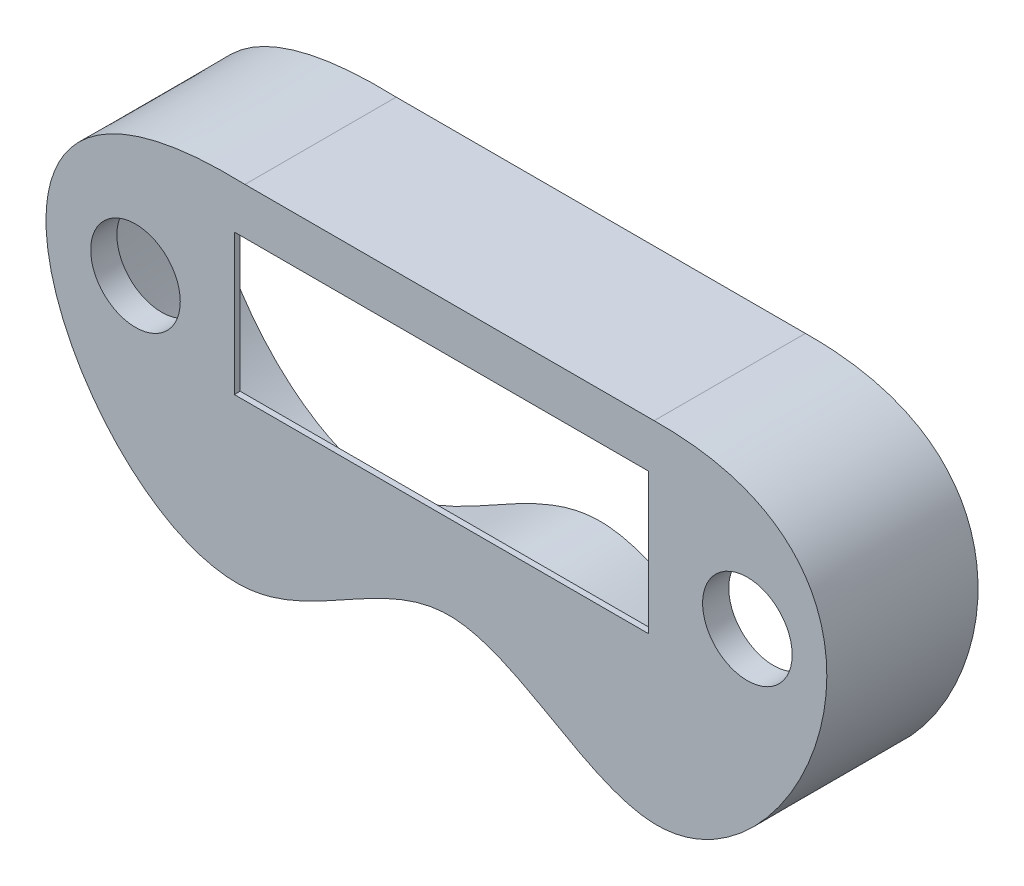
ISO-10303-21;
HEADER;
FILE_DESCRIPTION(('STEP AP214'),'2;1');
FILE_NAME('part.step','',(''),(''),'','','');
FILE_SCHEMA(('AUTOMOTIVE_DESIGN { 1 0 10303 214 1 1 1 1 }'));
ENDSEC;
DATA;
#1=APPLICATION_CONTEXT('core data for automotive mechanical design processes');
#2=APPLICATION_PROTOCOL_DEFINITION('international standard','automotive_design',2000,#1);
#3=PRODUCT_CONTEXT('',#1,'mechanical');
#4=PRODUCT('Part','Part','',(#3));
#5=PRODUCT_RELATED_PRODUCT_CATEGORY('part','',(#4));
#6=PRODUCT_DEFINITION_FORMATION('','',#4);
#7=PRODUCT_DEFINITION_CONTEXT('part definition',#1,'design');
#8=PRODUCT_DEFINITION('design','',#6,#7);
#9=PRODUCT_DEFINITION_SHAPE('','',#8);
#10=(LENGTH_UNIT() NAMED_UNIT(*) SI_UNIT(.MILLI.,.METRE.));
#11=(NAMED_UNIT(*) PLANE_ANGLE_UNIT() SI_UNIT($,.RADIAN.));
#12=(NAMED_UNIT(*) SI_UNIT($,.STERADIAN.) SOLID_ANGLE_UNIT());
#13=UNCERTAINTY_MEASURE_WITH_UNIT(LENGTH_MEASURE(1.E-05),#10,'distance_accuracy_value','');
#14=(GEOMETRIC_REPRESENTATION_CONTEXT(3) GLOBAL_UNCERTAINTY_ASSIGNED_CONTEXT((#13)) GLOBAL_UNIT_ASSIGNED_CONTEXT((#10,
#11,#12)) REPRESENTATION_CONTEXT('',''));
#15=CARTESIAN_POINT('',(0.,0.,0.));
#16=DIRECTION('',(0.,0.,1.));
#17=DIRECTION('',(1.,0.,0.));
#18=AXIS2_PLACEMENT_3D('',#15,#16,#17);
#19=CARTESIAN_POINT('',(66.9862942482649,13.1680978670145,25.));
#20=DIRECTION('',(0.,0.,-1.));
#21=DIRECTION('',(-1.,0.,0.));
#22=AXIS2_PLACEMENT_3D('',#19,#20,#21);
#23=PLANE('',#22);
#24=CARTESIAN_POINT('',(121.020961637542,37.,25.));
#25=DIRECTION('',(0.,0.,-1.));
#26=DIRECTION('',(-1.,0.,0.));
#27=AXIS2_PLACEMENT_3D('',#24,#25,#26);
#28=CIRCLE('',#27,8.7);
#29=CARTESIAN_POINT('',(112.320961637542,37.,25.));
#30=VERTEX_POINT('',#29);
#31=EDGE_CURVE('E220',#30,#30,#28,.T.);
#32=ORIENTED_EDGE('',*,*,#31,.F.);
#33=EDGE_LOOP('',(#32));
#34=FACE_BOUND('',#33,.T.);
#35=DIRECTION('',(0.,-1.,0.));
#36=VECTOR('',#35,1.);
#37=CARTESIAN_POINT('',(32.8209616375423,52.,25.));
#38=LINE('',#37,#36);
#39=CARTESIAN_POINT('',(32.8209616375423,52.,25.));
#40=VERTEX_POINT('',#39);
#41=CARTESIAN_POINT('',(32.8209616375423,27.8,25.));
#42=VERTEX_POINT('',#41);
#43=EDGE_CURVE('E102',#40,#42,#38,.T.);
#44=ORIENTED_EDGE('',*,*,#43,.T.);
#45=DIRECTION('',(1.,0.,0.));
#46=VECTOR('',#45,1.);
#47=CARTESIAN_POINT('',(32.8209616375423,27.8,25.));
#48=LINE('',#47,#46);
#49=CARTESIAN_POINT('',(104.020961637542,27.8,25.));
#50=VERTEX_POINT('',#49);
#51=EDGE_CURVE('E111',#42,#50,#48,.T.);
#52=ORIENTED_EDGE('',*,*,#51,.T.);
#53=DIRECTION('',(0.,1.,0.));
#54=VECTOR('',#53,1.);
#55=CARTESIAN_POINT('',(104.020961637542,52.,25.));
#56=LINE('',#55,#54);
#57=CARTESIAN_POINT('',(104.020961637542,52.,25.));
#58=VERTEX_POINT('',#57);
#59=EDGE_CURVE('E58',#50,#58,#56,.T.);
#60=ORIENTED_EDGE('',*,*,#59,.T.);
#61=DIRECTION('',(-1.,0.,0.));
#62=VECTOR('',#61,1.);
#63=CARTESIAN_POINT('',(32.8209616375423,52.,25.));
#64=LINE('',#63,#62);
#65=EDGE_CURVE('E108',#58,#40,#64,.T.);
#66=ORIENTED_EDGE('',*,*,#65,.T.);
#67=EDGE_LOOP('',(#44,#52,#60,#66));
#68=FACE_BOUND('',#67,.T.);
#69=DIRECTION('',(1.,0.,0.));
#70=VECTOR('',#69,1.);
#71=CARTESIAN_POINT('',(0.,58.9999999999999,25.));
#72=LINE('',#71,#70);
#73=CARTESIAN_POINT('',(34.624506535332,58.9999999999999,25.));
#74=VERTEX_POINT('',#73);
#75=CARTESIAN_POINT('',(105.006915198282,59.,25.));
#76=VERTEX_POINT('',#75);
#77=EDGE_CURVE('E179',#74,#76,#72,.T.);
#78=ORIENTED_EDGE('',*,*,#77,.T.);
#79=CARTESIAN_POINT('',(105.006915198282,59.,25.));
#80=CARTESIAN_POINT('',(105.58346015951,59.0079742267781,25.));
#81=CARTESIAN_POINT('',(106.752011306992,59.0080904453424,25.));
#82=CARTESIAN_POINT('',(108.966747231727,58.943056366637,25.));
#83=CARTESIAN_POINT('',(111.593085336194,58.7443101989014,25.));
#84=CARTESIAN_POINT('',(114.496149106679,58.3278689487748,25.));
#85=CARTESIAN_POINT('',(118.053041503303,57.5497613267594,25.));
#86=CARTESIAN_POINT('',(121.921890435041,56.1861513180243,25.));
#87=CARTESIAN_POINT('',(125.699578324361,54.0093779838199,25.));
#88=CARTESIAN_POINT('',(128.678526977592,51.3688904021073,25.));
#89=CARTESIAN_POINT('',(131.674290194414,47.3144216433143,25.));
#90=CARTESIAN_POINT('',(133.733239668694,41.3739552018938,25.));
#91=CARTESIAN_POINT('',(133.816286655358,33.3384646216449,25.));
#92=CARTESIAN_POINT('',(131.806173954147,25.0071790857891,25.));
#93=CARTESIAN_POINT('',(128.049800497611,17.0120563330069,25.));
#94=CARTESIAN_POINT('',(122.919330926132,9.9782658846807,25.));
#95=CARTESIAN_POINT('',(116.806001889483,4.51936076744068,25.));
#96=CARTESIAN_POINT('',(111.245995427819,1.7797108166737,25.));
#97=CARTESIAN_POINT('',(106.720157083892,0.922830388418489,25.));
#98=CARTESIAN_POINT('',(102.204810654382,1.05330629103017,25.));
#99=CARTESIAN_POINT('',(96.3780787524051,2.98192369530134,25.));
#100=CARTESIAN_POINT('',(89.1950098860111,6.8917359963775,25.));
#101=CARTESIAN_POINT('',(83.1167395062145,10.3817736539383,25.));
#102=CARTESIAN_POINT('',(78.1866427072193,12.6370818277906,25.));
#103=CARTESIAN_POINT('',(74.4460811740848,13.883623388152,25.));
#104=CARTESIAN_POINT('',(70.6425579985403,14.5071267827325,25.));
#105=CARTESIAN_POINT('',(66.8150626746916,14.2749616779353,25.));
#106=CARTESIAN_POINT('',(63.0709101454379,13.3268965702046,25.));
#107=CARTESIAN_POINT('',(58.148074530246,11.3738332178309,25.));
#108=CARTESIAN_POINT('',(52.0933599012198,8.06266457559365,25.));
#109=CARTESIAN_POINT('',(44.8965763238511,3.99869868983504,25.));
#110=CARTESIAN_POINT('',(38.9495996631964,1.59502137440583,25.));
#111=CARTESIAN_POINT('',(34.262565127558,0.859459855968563,25.));
#112=CARTESIAN_POINT('',(29.5475573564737,1.06754956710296,25.));
#113=CARTESIAN_POINT('',(23.6185066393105,2.94299631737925,25.));
#114=CARTESIAN_POINT('',(16.8448921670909,7.35296933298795,25.));
#115=CARTESIAN_POINT('',(10.8197590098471,13.4248528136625,25.));
#116=CARTESIAN_POINT('',(5.93792900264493,20.636092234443,25.));
#117=CARTESIAN_POINT('',(2.57751185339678,28.4510719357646,25.));
#118=CARTESIAN_POINT('',(1.09837936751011,36.3248536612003,25.));
#119=CARTESIAN_POINT('',(1.82573090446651,43.708803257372,25.));
#120=CARTESIAN_POINT('',(4.50038498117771,49.0569199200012,25.));
#121=CARTESIAN_POINT('',(8.07393673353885,52.6755619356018,25.));
#122=CARTESIAN_POINT('',(11.5401547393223,55.007725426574,25.));
#123=CARTESIAN_POINT('',(15.8569872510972,56.8924537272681,25.));
#124=CARTESIAN_POINT('',(20.2109369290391,58.0288488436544,25.));
#125=CARTESIAN_POINT('',(24.1734857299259,58.6400280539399,25.));
#126=CARTESIAN_POINT('',(27.3889243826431,58.940388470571,25.));
#127=CARTESIAN_POINT('',(30.2822998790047,59.0512011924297,25.));
#128=CARTESIAN_POINT('',(32.7139307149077,59.0523932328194,25.));
#129=CARTESIAN_POINT('',(33.9931384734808,59.0219994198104,25.));
#130=CARTESIAN_POINT('',(34.624506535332,58.9999999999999,25.));
#131=B_SPLINE_CURVE_WITH_KNOTS('',3,(#79,#80,#81,#82,#83,#84,#85,#86,#87,#88,#89,#90,#91,#92,
#93,#94,#95,#96,#97,#98,#99,#100,#101,#102,#103,#104,#105,#106,#107,#108,#109,#110,#111,#112,
#113,#114,#115,#116,#117,#118,#119,#120,#121,#122,#123,#124,#125,#126,#127,#128,#129,#130),
.UNSPECIFIED.,.F.,.F.,(4,1,1,1,1,1,1,1,1,1,1,1,1,1,1,1,1,1,1,1,1,1,1,1,1,1,1,1,1,1,1,1,1,1,1,1,
1,1,1,1,1,1,1,1,1,1,1,1,1,4),(-3.48833118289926E-05,0.00387156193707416,0.00777800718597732,
0.0155908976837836,0.0234037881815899,0.0312166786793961,0.0468424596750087,0.0624682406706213,
0.0780940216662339,0.0937198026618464,0.124971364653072,0.156222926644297,0.187474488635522,
0.218726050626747,0.249977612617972,0.281229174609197,0.312480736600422,0.328106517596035,
0.343732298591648,0.374983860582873,0.406235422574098,0.437486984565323,0.453112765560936,
0.468738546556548,0.484364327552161,0.499990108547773,0.515615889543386,0.531241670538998,
0.562493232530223,0.593744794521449,0.624996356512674,0.640622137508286,0.656247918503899,
0.687499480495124,0.718751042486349,0.750002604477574,0.781254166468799,0.812505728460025,
0.84375729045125,0.875008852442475,0.9062604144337,0.921886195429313,0.937511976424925,
0.953137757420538,0.96876353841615,0.976576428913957,0.984389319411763,0.992202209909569,
0.996108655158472,1.00001510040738),.UNSPECIFIED.);
#132=EDGE_CURVE('E172',#76,#74,#131,.T.);
#133=ORIENTED_EDGE('',*,*,#132,.T.);
#134=EDGE_LOOP('',(#78,#133));
#135=FACE_BOUND('',#134,.T.);
#136=CARTESIAN_POINT('',(15.8209616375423,37.,25.));
#137=DIRECTION('',(0.,0.,-1.));
#138=DIRECTION('',(-1.,0.,0.));
#139=AXIS2_PLACEMENT_3D('',#136,#137,#138);
#140=CIRCLE('',#139,8.7);
#141=CARTESIAN_POINT('',(7.12096163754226,37.,25.));
#142=VERTEX_POINT('',#141);
#143=EDGE_CURVE('E294',#142,#142,#140,.T.);
#144=ORIENTED_EDGE('',*,*,#143,.F.);
#145=EDGE_LOOP('',(#144));
#146=FACE_BOUND('',#145,.T.);
#147=ADVANCED_FACE('F33',(#34,#68,#135,#146),#23,.T.);
#148=CARTESIAN_POINT('',(0.,58.9999999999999,25.));
#149=DIRECTION('',(0.,1.,0.));
#150=DIRECTION('',(-1.,0.,0.));
#151=AXIS2_PLACEMENT_3D('',#148,#149,#150);
#152=PLANE('',#151);
#153=DIRECTION('',(1.,0.,0.));
#154=VECTOR('',#153,1.);
#155=CARTESIAN_POINT('',(0.,58.9999999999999,0.));
#156=LINE('',#155,#154);
#157=CARTESIAN_POINT('',(34.624506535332,58.9999999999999,0.));
#158=VERTEX_POINT('',#157);
#159=CARTESIAN_POINT('',(105.006915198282,59.,0.));
#160=VERTEX_POINT('',#159);
#161=EDGE_CURVE('E190',#158,#160,#156,.T.);
#162=ORIENTED_EDGE('',*,*,#161,.T.);
#163=DIRECTION('',(0.,0.,-1.));
#164=VECTOR('',#163,1.);
#165=CARTESIAN_POINT('',(105.006915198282,59.,25.));
#166=LINE('',#165,#164);
#167=EDGE_CURVE('E11',#76,#160,#166,.T.);
#168=ORIENTED_EDGE('',*,*,#167,.F.);
#169=ORIENTED_EDGE('',*,*,#77,.F.);
#170=DIRECTION('',(0.,0.,-1.));
#171=VECTOR('',#170,1.);
#172=CARTESIAN_POINT('',(34.624506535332,58.9999999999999,25.));
#173=LINE('',#172,#171);
#174=EDGE_CURVE('E42',#74,#158,#173,.T.);
#175=ORIENTED_EDGE('',*,*,#174,.T.);
#176=EDGE_LOOP('',(#162,#168,#169,#175));
#177=FACE_BOUND('',#176,.T.);
#178=ADVANCED_FACE('F163',(#177),#152,.F.);
#179=CARTESIAN_POINT('',(0.,60.,25.));
#180=DIRECTION('',(0.,1.,0.));
#181=DIRECTION('',(-1.,0.,0.));
#182=AXIS2_PLACEMENT_3D('',#179,#180,#181);
#183=PLANE('',#182);
#184=DIRECTION('',(1.,0.,0.));
#185=VECTOR('',#184,1.);
#186=CARTESIAN_POINT('',(0.,60.,0.));
#187=LINE('',#186,#185);
#188=CARTESIAN_POINT('',(34.6419232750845,60.,0.));
#189=VERTEX_POINT('',#188);
#190=CARTESIAN_POINT('',(105.,60.,0.));
#191=VERTEX_POINT('',#190);
#192=EDGE_CURVE('E142',#189,#191,#187,.T.);
#193=ORIENTED_EDGE('',*,*,#192,.F.);
#194=DIRECTION('',(0.,0.,-1.));
#195=VECTOR('',#194,1.);
#196=CARTESIAN_POINT('',(34.6419232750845,60.,25.));
#197=LINE('',#196,#195);
#198=CARTESIAN_POINT('',(34.6419232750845,60.,26.));
#199=VERTEX_POINT('',#198);
#200=EDGE_CURVE('E37',#199,#189,#197,.T.);
#201=ORIENTED_EDGE('',*,*,#200,.F.);
#202=DIRECTION('',(-1.,0.,0.));
#203=VECTOR('',#202,1.);
#204=CARTESIAN_POINT('',(105.,60.,26.));
#205=LINE('',#204,#203);
#206=CARTESIAN_POINT('',(105.,60.,26.));
#207=VERTEX_POINT('',#206);
#208=EDGE_CURVE('E139',#207,#199,#205,.T.);
#209=ORIENTED_EDGE('',*,*,#208,.F.);
#210=DIRECTION('',(0.,0.,-1.));
#211=VECTOR('',#210,1.);
#212=CARTESIAN_POINT('',(105.,60.,25.));
#213=LINE('',#212,#211);
#214=EDGE_CURVE('E178',#207,#191,#213,.T.);
#215=ORIENTED_EDGE('',*,*,#214,.T.);
#216=EDGE_LOOP('',(#193,#201,#209,#215));
#217=FACE_BOUND('',#216,.T.);
#218=ADVANCED_FACE('F35',(#217),#183,.T.);
#219=CARTESIAN_POINT('',(34.6419232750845,60.,25.));
#220=CARTESIAN_POINT('',(-25.3582610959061,62.0906493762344,25.));
#221=CARTESIAN_POINT('',(19.3164892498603,-29.1951791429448,25.));
#222=CARTESIAN_POINT('',(69.755708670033,26.1751368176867,25.));
#223=CARTESIAN_POINT('',(119.496084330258,-28.3157012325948,25.));
#224=CARTESIAN_POINT('',(156.274302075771,60.7091778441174,25.));
#225=CARTESIAN_POINT('',(105.,60.,25.));
#226=B_SPLINE_CURVE_WITH_KNOTS('',3,(#219,#220,#221,#222,#223,#224,#225),.UNSPECIFIED.,.F.,.F.,
(4,1,1,1,4),(0.,0.360734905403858,0.513077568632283,0.664071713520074,1.),.UNSPECIFIED.);
#227=DIRECTION('',(0.,0.,-1.));
#228=VECTOR('',#227,1.);
#229=SURFACE_OF_LINEAR_EXTRUSION('',#226,#228);
#230=CARTESIAN_POINT('',(34.6419232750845,60.,0.));
#231=CARTESIAN_POINT('',(-25.3582610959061,62.0906493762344,0.));
#232=CARTESIAN_POINT('',(19.3164892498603,-29.1951791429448,0.));
#233=CARTESIAN_POINT('',(69.755708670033,26.1751368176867,0.));
#234=CARTESIAN_POINT('',(119.496084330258,-28.3157012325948,0.));
#235=CARTESIAN_POINT('',(156.274302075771,60.7091778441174,0.));
#236=CARTESIAN_POINT('',(105.,60.,0.));
#237=B_SPLINE_CURVE_WITH_KNOTS('',3,(#230,#231,#232,#233,#234,#235,#236),.UNSPECIFIED.,.F.,.F.,
(4,1,1,1,4),(0.,0.360734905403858,0.513077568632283,0.664071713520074,1.),.UNSPECIFIED.);
#238=EDGE_CURVE('E185',#189,#191,#237,.T.);
#239=ORIENTED_EDGE('',*,*,#238,.T.);
#240=ORIENTED_EDGE('',*,*,#214,.F.);
#241=CARTESIAN_POINT('',(34.6419232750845,60.,26.));
#242=CARTESIAN_POINT('',(34.2702745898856,60.0129476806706,26.));
#243=CARTESIAN_POINT('',(33.8985447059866,60.0234821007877,26.));
#244=CARTESIAN_POINT('',(33.1549663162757,60.0394862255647,26.));
#245=CARTESIAN_POINT('',(32.7831178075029,60.0449557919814,26.));
#246=CARTESIAN_POINT('',(31.6635713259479,60.0534387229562,26.));
#247=CARTESIAN_POINT('',(30.9157903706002,60.0483845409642,26.));
#248=CARTESIAN_POINT('',(29.4184916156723,60.0145949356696,26.));
#249=CARTESIAN_POINT('',(28.6689753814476,59.9857881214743,26.));
#250=CARTESIAN_POINT('',(27.1705778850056,59.9018145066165,26.));
#251=CARTESIAN_POINT('',(26.4216981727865,59.8466193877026,26.));
#252=CARTESIAN_POINT('',(24.9096023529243,59.7053447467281,26.));
#253=CARTESIAN_POINT('',(24.1464482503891,59.6185903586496,26.));
#254=CARTESIAN_POINT('',(22.6257195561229,59.4109862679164,26.));
#255=CARTESIAN_POINT('',(21.8681390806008,59.2901802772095,26.));
#256=CARTESIAN_POINT('',(20.361147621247,59.0105739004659,26.));
#257=CARTESIAN_POINT('',(19.611725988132,58.8518314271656,26.));
#258=CARTESIAN_POINT('',(18.1236428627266,58.4918210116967,26.));
#259=CARTESIAN_POINT('',(17.3849730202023,58.2905881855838,26.));
#260=CARTESIAN_POINT('',(16.25059103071,57.9415837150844,26.));
#261=CARTESIAN_POINT('',(15.8497497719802,57.8103538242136,26.));
#262=CARTESIAN_POINT('',(15.0533470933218,57.5325457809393,26.));
#263=CARTESIAN_POINT('',(14.6577862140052,57.3859660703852,26.));
#264=CARTESIAN_POINT('',(13.8730180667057,57.0765847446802,26.));
#265=CARTESIAN_POINT('',(13.4838111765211,56.9137821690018,26.));
#266=CARTESIAN_POINT('',(12.7144085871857,56.5717335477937,26.));
#267=CARTESIAN_POINT('',(12.3341846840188,56.3925511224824,26.));
#268=CARTESIAN_POINT('',(11.5826060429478,56.0164212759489,26.));
#269=CARTESIAN_POINT('',(11.2112512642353,55.8194739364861,26.));
#270=CARTESIAN_POINT('',(10.4789127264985,55.4070820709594,26.));
#271=CARTESIAN_POINT('',(10.1179293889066,55.1916367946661,26.));
#272=CARTESIAN_POINT('',(9.40302799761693,54.7384986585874,26.));
#273=CARTESIAN_POINT('',(9.04928093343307,54.500535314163,26.));
#274=CARTESIAN_POINT('',(8.35607881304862,54.0045703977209,26.));
#275=CARTESIAN_POINT('',(8.01662411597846,53.7465683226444,26.));
#276=CARTESIAN_POINT('',(7.3540063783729,53.2103789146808,26.));
#277=CARTESIAN_POINT('',(7.03084358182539,52.9321912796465,26.));
#278=CARTESIAN_POINT('',(6.40311704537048,52.3560586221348,26.));
#279=CARTESIAN_POINT('',(6.09853764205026,52.0581306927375,26.));
#280=CARTESIAN_POINT('',(5.50964513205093,51.4428295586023,26.));
#281=CARTESIAN_POINT('',(5.22533244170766,51.1254559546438,26.));
#282=CARTESIAN_POINT('',(4.6788704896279,50.4722820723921,26.));
#283=CARTESIAN_POINT('',(4.41671731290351,50.1364850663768,26.));
#284=CARTESIAN_POINT('',(3.82904181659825,49.3278695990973,26.));
#285=CARTESIAN_POINT('',(3.5131600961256,48.8479896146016,26.));
#286=CARTESIAN_POINT('',(2.92737123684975,47.8610492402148,26.));
#287=CARTESIAN_POINT('',(2.65746130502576,47.3539905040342,26.));
#288=CARTESIAN_POINT('',(2.16495128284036,46.3171266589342,26.));
#289=CARTESIAN_POINT('',(1.94237433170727,45.7873105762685,26.));
#290=CARTESIAN_POINT('',(1.54484536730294,44.7101527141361,26.));
#291=CARTESIAN_POINT('',(1.36989425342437,44.1628106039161,26.));
#292=CARTESIAN_POINT('',(1.0774341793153,43.0951606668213,26.));
#293=CARTESIAN_POINT('',(0.956707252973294,42.5757263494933,26.));
#294=CARTESIAN_POINT('',(0.753790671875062,41.5292461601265,26.));
#295=CARTESIAN_POINT('',(0.671614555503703,41.0021976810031,26.));
#296=CARTESIAN_POINT('',(0.543884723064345,39.9437422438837,26.));
#297=CARTESIAN_POINT('',(0.498330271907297,39.412335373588,26.));
#298=CARTESIAN_POINT('',(0.441625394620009,38.3478446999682,26.));
#299=CARTESIAN_POINT('',(0.430470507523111,37.8147611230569,26.));
#300=CARTESIAN_POINT('',(0.443387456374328,36.409904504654,26.));
#301=CARTESIAN_POINT('',(0.494368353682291,35.5383054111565,26.));
#302=CARTESIAN_POINT('',(0.672632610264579,33.8028996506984,26.));
#303=CARTESIAN_POINT('',(0.799954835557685,32.9390971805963,26.));
#304=CARTESIAN_POINT('',(1.1226976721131,31.2223211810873,26.));
#305=CARTESIAN_POINT('',(1.31828038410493,30.3693784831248,26.));
#306=CARTESIAN_POINT('',(1.7701338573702,28.6798981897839,26.));
#307=CARTESIAN_POINT('',(2.02640272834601,27.8433600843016,26.));
#308=CARTESIAN_POINT('',(2.57927661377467,26.2308870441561,26.));
#309=CARTESIAN_POINT('',(2.8731933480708,25.4540242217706,26.));
#310=CARTESIAN_POINT('',(3.50623582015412,23.9186784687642,26.));
#311=CARTESIAN_POINT('',(3.84537728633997,23.1602020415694,26.));
#312=CARTESIAN_POINT('',(4.56548226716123,21.6632565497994,26.));
#313=CARTESIAN_POINT('',(4.94645286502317,20.9247909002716,26.));
#314=CARTESIAN_POINT('',(5.74824859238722,19.4680800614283,26.));
#315=CARTESIAN_POINT('',(6.1691456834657,18.7498745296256,26.));
#316=CARTESIAN_POINT('',(7.04804846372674,17.336751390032,26.));
#317=CARTESIAN_POINT('',(7.50604678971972,16.6418291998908,26.));
#318=CARTESIAN_POINT('',(8.45765566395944,15.2768544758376,26.));
#319=CARTESIAN_POINT('',(8.95126483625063,14.6068009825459,26.));
#320=CARTESIAN_POINT('',(9.98389262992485,13.2795344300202,26.));
#321=CARTESIAN_POINT('',(10.5236548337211,12.6228993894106,26.));
#322=CARTESIAN_POINT('',(11.6384412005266,11.3401459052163,26.));
#323=CARTESIAN_POINT('',(12.2134683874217,10.7140300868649,26.));
#324=CARTESIAN_POINT('',(13.3985106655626,9.49529404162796,26.));
#325=CARTESIAN_POINT('',(14.0085394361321,8.90268709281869,26.));
#326=CARTESIAN_POINT('',(15.261071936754,7.75704663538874,26.));
#327=CARTESIAN_POINT('',(15.9034616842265,7.2038888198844,26.));
#328=CARTESIAN_POINT('',(17.2222074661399,6.13999987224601,26.));
#329=CARTESIAN_POINT('',(17.898552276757,5.62925486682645,26.));
#330=CARTESIAN_POINT('',(19.2847107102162,4.65631376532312,26.));
#331=CARTESIAN_POINT('',(19.9944976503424,4.19407988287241,26.));
#332=CARTESIAN_POINT('',(21.3031791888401,3.41138619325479,26.));
#333=CARTESIAN_POINT('',(21.8961346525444,3.08099339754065,26.));
#334=CARTESIAN_POINT('',(23.1027173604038,2.46048816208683,26.));
#335=CARTESIAN_POINT('',(23.7163399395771,2.17036670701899,26.));
#336=CARTESIAN_POINT('',(24.9627825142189,1.63573265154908,26.));
#337=CARTESIAN_POINT('',(25.5955905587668,1.39119231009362,26.));
#338=CARTESIAN_POINT('',(26.8788473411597,0.953379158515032,26.));
#339=CARTESIAN_POINT('',(27.5292936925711,0.760099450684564,26.));
#340=CARTESIAN_POINT('',(28.5565379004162,0.503167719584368,26.));
#341=CARTESIAN_POINT('',(28.9284819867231,0.419808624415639,26.));
#342=CARTESIAN_POINT('',(29.6761928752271,0.272411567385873,26.));
#343=CARTESIAN_POINT('',(30.0519594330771,0.208372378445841,26.));
#344=CARTESIAN_POINT('',(30.8064248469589,0.100714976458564,26.));
#345=CARTESIAN_POINT('',(31.1851237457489,0.0570970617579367,26.));
#346=CARTESIAN_POINT('',(31.9433126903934,-0.00860751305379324,26.));
#347=CARTESIAN_POINT('',(32.3227974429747,-0.0307549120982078,26.));
#348=CARTESIAN_POINT('',(33.0824457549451,-0.0528396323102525,26.));
#349=CARTESIAN_POINT('',(33.4626093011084,-0.0527773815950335,26.));
#350=CARTESIAN_POINT('',(34.0322399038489,-0.0355278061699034,26.));
#351=CARTESIAN_POINT('',(34.2219987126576,-0.0269199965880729,26.));
#352=CARTESIAN_POINT('',(34.6011737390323,-0.00389688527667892,26.));
#353=CARTESIAN_POINT('',(34.7905899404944,0.010518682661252,26.));
#354=CARTESIAN_POINT('',(35.3291063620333,0.0596586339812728,26.));
#355=CARTESIAN_POINT('',(35.6775997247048,0.101243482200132,26.));
#356=CARTESIAN_POINT('',(36.3719977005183,0.202242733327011,26.));
#357=CARTESIAN_POINT('',(36.7179018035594,0.261660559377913,26.));
#358=CARTESIAN_POINT('',(37.7511908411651,0.464349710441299,26.));
#359=CARTESIAN_POINT('',(38.433859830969,0.632027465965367,26.));
#360=CARTESIAN_POINT('',(39.7874168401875,1.02051772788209,26.));
#361=CARTESIAN_POINT('',(40.4582214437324,1.24161198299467,26.));
#362=CARTESIAN_POINT('',(41.7845095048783,1.72463658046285,26.));
#363=CARTESIAN_POINT('',(42.4399984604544,1.98655200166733,26.));
#364=CARTESIAN_POINT('',(43.5179687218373,2.44742711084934,26.));
#365=CARTESIAN_POINT('',(43.9442304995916,2.63769447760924,26.));
#366=CARTESIAN_POINT('',(44.7916457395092,3.02932159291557,26.));
#367=CARTESIAN_POINT('',(45.2127989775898,3.23068182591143,26.));
#368=CARTESIAN_POINT('',(46.0509895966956,3.64236950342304,26.));
#369=CARTESIAN_POINT('',(46.4680243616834,3.85270224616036,26.));
#370=CARTESIAN_POINT('',(47.2985715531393,4.28022565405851,26.));
#371=CARTESIAN_POINT('',(47.7120838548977,4.49741656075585,26.));
#372=CARTESIAN_POINT('',(48.9491020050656,5.15673990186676,26.));
#373=CARTESIAN_POINT('',(49.7685911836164,5.60637288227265,26.));
#374=CARTESIAN_POINT('',(51.4038791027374,6.51215418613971,26.));
#375=CARTESIAN_POINT('',(52.2196778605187,6.96830247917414,26.));
#376=CARTESIAN_POINT('',(53.8542369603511,7.87402887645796,26.));
#377=CARTESIAN_POINT('',(54.6729948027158,8.32361139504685,26.));
#378=CARTESIAN_POINT('',(55.9090642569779,8.98288996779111,26.));
#379=CARTESIAN_POINT('',(56.3223474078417,9.20010241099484,26.));
#380=CARTESIAN_POINT('',(57.1524899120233,9.62756672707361,26.));
#381=CARTESIAN_POINT('',(57.5693491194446,9.83781888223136,26.));
#382=CARTESIAN_POINT('',(58.3964936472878,10.2438224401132,26.));
#383=CARTESIAN_POINT('',(58.8066625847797,10.4398099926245,26.));
#384=CARTESIAN_POINT('',(59.632086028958,10.8209980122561,26.));
#385=CARTESIAN_POINT('',(60.0473413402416,11.0061967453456,26.));
#386=CARTESIAN_POINT('',(60.8836568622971,11.3633032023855,26.));
#387=CARTESIAN_POINT('',(61.3047182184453,11.5352082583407,26.));
#388=CARTESIAN_POINT('',(62.1521742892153,11.862462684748,26.));
#389=CARTESIAN_POINT('',(62.578554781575,12.0178486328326,26.));
#390=CARTESIAN_POINT('',(63.4378605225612,12.3092759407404,26.));
#391=CARTESIAN_POINT('',(63.8707849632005,12.4453196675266,26.));
#392=CARTESIAN_POINT('',(64.7432418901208,12.6944910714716,26.));
#393=CARTESIAN_POINT('',(65.1827738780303,12.8076204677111,26.));
#394=CARTESIAN_POINT('',(65.8797789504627,12.964664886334,26.));
#395=CARTESIAN_POINT('',(66.1352438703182,13.0175630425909,26.));
#396=CARTESIAN_POINT('',(66.6479977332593,13.1137219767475,26.));
#397=CARTESIAN_POINT('',(66.9052866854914,13.1569827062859,26.));
#398=CARTESIAN_POINT('',(67.4213372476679,13.2330855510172,26.));
#399=CARTESIAN_POINT('',(67.6800984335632,13.2659305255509,26.));
#400=CARTESIAN_POINT('',(68.1987399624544,13.320467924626,26.));
#401=CARTESIAN_POINT('',(68.4586200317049,13.3421629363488,26.));
#402=CARTESIAN_POINT('',(68.9785165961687,13.3736767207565,26.));
#403=CARTESIAN_POINT('',(69.2385313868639,13.383522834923,26.));
#404=CARTESIAN_POINT('',(69.6286914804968,13.3890063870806,26.));
#405=CARTESIAN_POINT('',(69.7587840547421,13.3892860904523,26.));
#406=CARTESIAN_POINT('',(70.0189372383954,13.3866714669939,26.));
#407=CARTESIAN_POINT('',(70.1489978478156,13.3837771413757,26.));
#408=CARTESIAN_POINT('',(70.539048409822,13.3704001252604,26.));
#409=CARTESIAN_POINT('',(70.7988911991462,13.3552231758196,26.));
#410=CARTESIAN_POINT('',(71.3175718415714,13.3130927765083,26.));
#411=CARTESIAN_POINT('',(71.5764097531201,13.2861400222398,26.));
#412=CARTESIAN_POINT('',(72.2916982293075,13.1961998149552,26.));
#413=CARTESIAN_POINT('',(72.7467020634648,13.1214498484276,26.));
#414=CARTESIAN_POINT('',(73.6509000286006,12.9418907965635,26.));
#415=CARTESIAN_POINT('',(74.1000901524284,12.8370620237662,26.));
#416=CARTESIAN_POINT('',(74.9917729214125,12.6017489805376,26.));
#417=CARTESIAN_POINT('',(75.4342635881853,12.4712572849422,26.));
#418=CARTESIAN_POINT('',(76.3153059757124,12.187721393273,26.));
#419=CARTESIAN_POINT('',(76.7538085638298,12.0345259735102,26.));
#420=CARTESIAN_POINT('',(77.6237917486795,11.7100386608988,26.));
#421=CARTESIAN_POINT('',(78.0552754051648,11.5387549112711,26.));
#422=CARTESIAN_POINT('',(78.9119199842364,11.1812878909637,26.));
#423=CARTESIAN_POINT('',(79.3370817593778,10.9951066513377,26.));
#424=CARTESIAN_POINT('',(80.124530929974,10.6367261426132,26.));
#425=CARTESIAN_POINT('',(80.4875198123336,10.4660589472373,26.));
#426=CARTESIAN_POINT('',(81.2099003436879,10.1172580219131,26.));
#427=CARTESIAN_POINT('',(81.5692918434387,9.9391239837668,26.));
#428=CARTESIAN_POINT('',(82.6431227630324,9.39559232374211,26.));
#429=CARTESIAN_POINT('',(83.3529851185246,9.02117364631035,26.));
#430=CARTESIAN_POINT('',(84.7652664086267,8.25816469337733,26.));
#431=CARTESIAN_POINT('',(85.4676826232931,7.86956945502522,26.));
#432=CARTESIAN_POINT('',(86.8686650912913,7.08740111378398,26.));
#433=CARTESIAN_POINT('',(87.5672348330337,6.69383422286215,26.));
#434=CARTESIAN_POINT('',(88.9656417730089,5.90959432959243,26.));
#435=CARTESIAN_POINT('',(89.6654783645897,5.51892024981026,26.));
#436=CARTESIAN_POINT('',(91.0711907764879,4.74870649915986,26.));
#437=CARTESIAN_POINT('',(91.7770656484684,4.36916511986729,26.));
#438=CARTESIAN_POINT('',(92.9399742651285,3.76531583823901,26.));
#439=CARTESIAN_POINT('',(93.3938225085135,3.53489946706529,26.));
#440=CARTESIAN_POINT('',(94.3070359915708,3.08507343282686,26.));
#441=CARTESIAN_POINT('',(94.7664018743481,2.86566506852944,26.));
#442=CARTESIAN_POINT('',(95.6918211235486,2.44096560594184,26.));
#443=CARTESIAN_POINT('',(96.1578764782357,2.2356788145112,26.));
#444=CARTESIAN_POINT('',(97.0964656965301,1.8433801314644,26.));
#445=CARTESIAN_POINT('',(97.5689830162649,1.65632895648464,26.));
#446=CARTESIAN_POINT('',(98.5221009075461,1.30424799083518,26.));
#447=CARTESIAN_POINT('',(99.0026997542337,1.13921356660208,26.));
#448=CARTESIAN_POINT('',(99.9722779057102,0.836025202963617,26.));
#449=CARTESIAN_POINT('',(100.461254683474,0.69786330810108,26.));
#450=CARTESIAN_POINT('',(101.285971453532,0.493790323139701,26.));
#451=CARTESIAN_POINT('',(101.619525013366,0.41902771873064,26.));
#452=CARTESIAN_POINT('',(102.289890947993,0.285947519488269,26.));
#453=CARTESIAN_POINT('',(102.626702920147,0.227627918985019,26.));
#454=CARTESIAN_POINT('',(103.302930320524,0.129257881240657,26.));
#455=CARTESIAN_POINT('',(103.642345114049,0.0892031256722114,26.));
#456=CARTESIAN_POINT('',(104.322265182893,0.0291749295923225,26.));
#457=CARTESIAN_POINT('',(104.662766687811,0.00915962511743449,26.));
#458=CARTESIAN_POINT('',(105.344427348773,-0.00935580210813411,26.));
#459=CARTESIAN_POINT('',(105.68558660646,-0.00785227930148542,26.));
#460=CARTESIAN_POINT('',(106.367125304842,0.0161438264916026,26.));
#461=CARTESIAN_POINT('',(106.707504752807,0.0386362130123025,26.));
#462=CARTESIAN_POINT('',(107.555682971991,0.120166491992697,26.));
#463=CARTESIAN_POINT('',(108.062306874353,0.191836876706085,26.));
#464=CARTESIAN_POINT('',(109.067629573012,0.377526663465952,26.));
#465=CARTESIAN_POINT('',(109.5663277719,0.491549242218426,26.));
#466=CARTESIAN_POINT('',(110.554754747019,0.758723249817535,26.));
#467=CARTESIAN_POINT('',(111.044450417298,0.911996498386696,26.));
#468=CARTESIAN_POINT('',(112.011343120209,1.25372025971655,26.));
#469=CARTESIAN_POINT('',(112.488539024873,1.44217393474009,26.));
#470=CARTESIAN_POINT('',(113.654271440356,1.94837486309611,26.));
#471=CARTESIAN_POINT('',(114.334712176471,2.28484813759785,26.));
#472=CARTESIAN_POINT('',(115.663454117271,3.01620439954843,26.));
#473=CARTESIAN_POINT('',(116.311740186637,3.41111455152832,26.));
#474=CARTESIAN_POINT('',(117.575897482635,4.25074622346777,26.));
#475=CARTESIAN_POINT('',(118.191738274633,4.69551332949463,26.));
#476=CARTESIAN_POINT('',(119.390431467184,5.62723834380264,26.));
#477=CARTESIAN_POINT('',(119.973284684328,6.11419520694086,26.));
#478=CARTESIAN_POINT('',(121.109069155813,7.12673575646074,26.));
#479=CARTESIAN_POINT('',(121.661852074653,7.6524852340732,26.));
#480=CARTESIAN_POINT('',(122.735373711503,8.73608352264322,26.));
#481=CARTESIAN_POINT('',(123.256098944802,9.29394565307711,26.));
#482=CARTESIAN_POINT('',(124.265792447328,10.4378245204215,26.));
#483=CARTESIAN_POINT('',(124.754754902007,11.0238463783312,26.));
#484=CARTESIAN_POINT('',(125.701934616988,12.2219142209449,26.));
#485=CARTESIAN_POINT('',(126.160094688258,12.8340053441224,26.));
#486=CARTESIAN_POINT('',(127.044616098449,14.0805146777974,26.));
#487=CARTESIAN_POINT('',(127.4709846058,14.7149278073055,26.));
#488=CARTESIAN_POINT('',(128.291755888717,16.0040669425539,26.));
#489=CARTESIAN_POINT('',(128.68615946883,16.658792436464,26.));
#490=CARTESIAN_POINT('',(129.455434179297,18.009611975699,26.));
#491=CARTESIAN_POINT('',(129.829167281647,18.7063543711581,26.));
#492=CARTESIAN_POINT('',(130.54079141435,20.1179687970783,26.));
#493=CARTESIAN_POINT('',(130.878680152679,20.8328419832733,26.));
#494=CARTESIAN_POINT('',(131.51716027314,22.2792544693,26.));
#495=CARTESIAN_POINT('',(131.817743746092,23.0107972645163,26.));
#496=CARTESIAN_POINT('',(132.379028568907,24.4875631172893,26.));
#497=CARTESIAN_POINT('',(132.639800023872,25.2327594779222,26.));
#498=CARTESIAN_POINT('',(133.119507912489,26.7363943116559,26.));
#499=CARTESIAN_POINT('',(133.338451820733,27.4948303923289,26.));
#500=CARTESIAN_POINT('',(133.731308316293,29.0230240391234,26.));
#501=CARTESIAN_POINT('',(133.905238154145,29.7927771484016,26.));
#502=CARTESIAN_POINT('',(134.203340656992,31.3368067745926,26.));
#503=CARTESIAN_POINT('',(134.327826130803,32.1110223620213,26.));
#504=CARTESIAN_POINT('',(134.524092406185,33.6661347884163,26.));
#505=CARTESIAN_POINT('',(134.59587614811,34.4470312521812,26.));
#506=CARTESIAN_POINT('',(134.681436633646,36.0113837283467,26.));
#507=CARTESIAN_POINT('',(134.695276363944,36.7948360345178,26.));
#508=CARTESIAN_POINT('',(134.668265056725,37.9686904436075,26.));
#509=CARTESIAN_POINT('',(134.651301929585,38.3597310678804,26.));
#510=CARTESIAN_POINT('',(134.600681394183,39.1408405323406,26.));
#511=CARTESIAN_POINT('',(134.567019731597,39.5309090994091,26.));
#512=CARTESIAN_POINT('',(134.457906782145,40.5322528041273,26.));
#513=CARTESIAN_POINT('',(134.369561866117,41.1421891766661,26.));
#514=CARTESIAN_POINT('',(134.146718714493,42.3534351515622,26.));
#515=CARTESIAN_POINT('',(134.01223258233,42.9547469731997,26.));
#516=CARTESIAN_POINT('',(133.694583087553,44.1441256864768,26.));
#517=CARTESIAN_POINT('',(133.511454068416,44.7322016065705,26.));
#518=CARTESIAN_POINT('',(133.198942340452,45.6005826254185,26.));
#519=CARTESIAN_POINT('',(133.088451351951,45.8877918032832,26.));
#520=CARTESIAN_POINT('',(132.854728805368,46.456982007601,26.));
#521=CARTESIAN_POINT('',(132.731497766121,46.7389632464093,26.));
#522=CARTESIAN_POINT('',(132.427567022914,47.3931241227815,26.));
#523=CARTESIAN_POINT('',(132.241693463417,47.7629152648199,26.));
#524=CARTESIAN_POINT('',(131.846936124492,48.4900256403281,26.));
#525=CARTESIAN_POINT('',(131.638051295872,48.8473443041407,26.));
#526=CARTESIAN_POINT('',(131.197744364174,49.5478082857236,26.));
#527=CARTESIAN_POINT('',(130.96632315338,49.8909541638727,26.));
#528=CARTESIAN_POINT('',(130.481798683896,50.5614413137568,26.));
#529=CARTESIAN_POINT('',(130.228701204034,50.8887867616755,26.));
#530=CARTESIAN_POINT('',(129.701860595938,51.5264416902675,26.));
#531=CARTESIAN_POINT('',(129.428116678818,51.8367505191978,26.));
#532=CARTESIAN_POINT('',(128.86141979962,52.4391864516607,26.));
#533=CARTESIAN_POINT('',(128.568469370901,52.731315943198,26.));
#534=CARTESIAN_POINT('',(127.869255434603,53.3862199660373,26.));
#535=CARTESIAN_POINT('',(127.45648377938,53.7420746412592,26.));
#536=CARTESIAN_POINT('',(126.604243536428,54.4199720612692,26.));
#537=CARTESIAN_POINT('',(126.164778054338,54.742018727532,26.));
#538=CARTESIAN_POINT('',(125.263051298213,55.3523623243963,26.));
#539=CARTESIAN_POINT('',(124.800789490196,55.6406584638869,26.));
#540=CARTESIAN_POINT('',(123.857237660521,56.1842454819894,26.));
#541=CARTESIAN_POINT('',(123.375944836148,56.4395314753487,26.));
#542=CARTESIAN_POINT('',(122.379656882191,56.9272566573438,26.));
#543=CARTESIAN_POINT('',(121.864074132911,57.1584912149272,26.));
#544=CARTESIAN_POINT('',(120.819421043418,57.5887370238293,26.));
#545=CARTESIAN_POINT('',(120.290344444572,57.7877329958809,26.));
#546=CARTESIAN_POINT('',(119.221738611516,58.1554944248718,26.));
#547=CARTESIAN_POINT('',(118.682207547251,58.3242545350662,26.));
#548=CARTESIAN_POINT('',(117.592773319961,58.634359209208,26.));
#549=CARTESIAN_POINT('',(117.042834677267,58.7755783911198,26.));
#550=CARTESIAN_POINT('',(115.937064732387,59.0318019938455,26.));
#551=CARTESIAN_POINT('',(115.381234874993,59.1468126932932,26.));
#552=CARTESIAN_POINT('',(114.265212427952,59.3527283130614,26.));
#553=CARTESIAN_POINT('',(113.70502028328,59.4436356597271,26.));
#554=CARTESIAN_POINT('',(112.691535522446,59.5876611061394,26.));
#555=CARTESIAN_POINT('',(112.238790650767,59.6446932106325,26.));
#556=CARTESIAN_POINT('',(111.331851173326,59.7453636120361,26.));
#557=CARTESIAN_POINT('',(110.877656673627,59.7890028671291,26.));
#558=CARTESIAN_POINT('',(109.968216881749,59.8637678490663,26.));
#559=CARTESIAN_POINT('',(109.512971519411,59.8948927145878,26.));
#560=CARTESIAN_POINT('',(108.607011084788,59.9451451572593,26.));
#561=CARTESIAN_POINT('',(108.156303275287,59.964404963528,26.));
#562=CARTESIAN_POINT('',(107.254607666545,59.9922019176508,26.));
#563=CARTESIAN_POINT('',(106.803619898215,60.000740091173,26.));
#564=CARTESIAN_POINT('',(105.90172781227,60.0077503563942,26.));
#565=CARTESIAN_POINT('',(105.450823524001,60.0062261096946,26.));
#566=CARTESIAN_POINT('',(105.,60.,26.));
#567=B_SPLINE_CURVE_WITH_KNOTS('',3,(#241,#242,#243,#244,#245,#246,#247,#248,#249,#250,#251,
#252,#253,#254,#255,#256,#257,#258,#259,#260,#261,#262,#263,#264,#265,#266,#267,#268,#269,#270,
#271,#272,#273,#274,#275,#276,#277,#278,#279,#280,#281,#282,#283,#284,#285,#286,#287,#288,#289,
#290,#291,#292,#293,#294,#295,#296,#297,#298,#299,#300,#301,#302,#303,#304,#305,#306,#307,#308,
#309,#310,#311,#312,#313,#314,#315,#316,#317,#318,#319,#320,#321,#322,#323,#324,#325,#326,#327,
#328,#329,#330,#331,#332,#333,#334,#335,#336,#337,#338,#339,#340,#341,#342,#343,#344,#345,#346,
#347,#348,#349,#350,#351,#352,#353,#354,#355,#356,#357,#358,#359,#360,#361,#362,#363,#364,#365,
#366,#367,#368,#369,#370,#371,#372,#373,#374,#375,#376,#377,#378,#379,#380,#381,#382,#383,#384,
#385,#386,#387,#388,#389,#390,#391,#392,#393,#394,#395,#396,#397,#398,#399,#400,#401,#402,#403,
#404,#405,#406,#407,#408,#409,#410,#411,#412,#413,#414,#415,#416,#417,#418,#419,#420,#421,#422,
#423,#424,#425,#426,#427,#428,#429,#430,#431,#432,#433,#434,#435,#436,#437,#438,#439,#440,#441,
#442,#443,#444,#445,#446,#447,#448,#449,#450,#451,#452,#453,#454,#455,#456,#457,#458,#459,#460,
#461,#462,#463,#464,#465,#466,#467,#468,#469,#470,#471,#472,#473,#474,#475,#476,#477,#478,#479,
#480,#481,#482,#483,#484,#485,#486,#487,#488,#489,#490,#491,#492,#493,#494,#495,#496,#497,#498,
#499,#500,#501,#502,#503,#504,#505,#506,#507,#508,#509,#510,#511,#512,#513,#514,#515,#516,#517,
#518,#519,#520,#521,#522,#523,#524,#525,#526,#527,#528,#529,#530,#531,#532,#533,#534,#535,#536,
#537,#538,#539,#540,#541,#542,#543,#544,#545,#546,#547,#548,#549,#550,#551,#552,#553,#554,#555,
#556,#557,#558,#559,#560,#561,#562,#563,#564,#565,#566),.UNSPECIFIED.,.F.,.F.,(4,2,2,2,2,2,2,2,
2,2,2,2,2,2,2,2,2,2,2,2,2,2,2,2,2,2,2,2,2,2,2,2,2,2,2,2,2,2,2,2,2,2,2,2,2,2,2,2,2,2,2,2,2,2,2,2,
2,2,2,2,2,2,2,2,2,2,2,2,2,2,2,2,2,2,2,2,2,2,2,2,2,2,2,2,2,2,2,2,2,2,2,2,2,2,2,2,2,2,2,2,2,2,2,2,
2,2,2,2,2,2,2,2,2,2,2,2,2,2,2,2,2,2,2,2,2,2,2,2,2,2,2,2,2,2,2,2,2,2,2,2,2,2,2,2,2,2,2,2,2,2,2,2,
2,2,2,2,2,2,2,2,2,2,4),(0.,1.11560704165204,2.23124453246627,4.474276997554,6.7240757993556,
8.97629438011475,11.2798154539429,13.5803928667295,15.8774804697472,18.1726770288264,
19.4377437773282,20.7029390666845,21.9682093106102,23.2287585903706,24.4893020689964,
25.7498966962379,27.0282365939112,28.3066085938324,29.5849997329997,30.8622980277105,
32.1396225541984,33.4167209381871,35.1376619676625,36.8584984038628,38.5801741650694,
40.301882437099,41.9002097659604,43.4990979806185,45.0979541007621,46.6966028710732,
49.3117579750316,51.9282456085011,54.5509894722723,57.17365165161,59.6639583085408,
62.155133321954,64.6467308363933,67.1429076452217,69.6385902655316,72.1341765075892,
74.6829501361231,77.2319426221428,79.7819381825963,82.3235067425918,84.8642406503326,
87.4029806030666,89.4380175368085,91.4725981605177,93.5059364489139,95.5390009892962,
96.6820806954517,97.8250877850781,98.9681115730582,100.107892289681,101.247651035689,
101.817436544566,102.387248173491,103.439585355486,104.492124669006,106.598081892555,
108.715399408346,110.831944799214,112.232188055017,113.632492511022,115.033635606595,
116.434828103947,119.238884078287,122.042926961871,124.844988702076,126.24560261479,
127.646159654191,129.009796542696,130.373652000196,131.73778047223,133.098822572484,
134.459697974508,135.82047124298,136.602967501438,137.385467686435,138.167752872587,
138.949856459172,139.730151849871,140.120396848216,140.510641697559,141.291179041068,
142.071670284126,143.453696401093,144.836629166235,146.219962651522,147.612962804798,
149.00533849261,150.397524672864,151.600753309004,152.804031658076,155.211360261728,
157.619539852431,160.024960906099,162.429435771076,164.833539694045,166.360395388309,
167.887430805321,169.41492989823,170.939062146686,172.462873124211,173.986232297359,
175.011370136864,176.036382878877,177.061153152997,178.083778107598,179.106576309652,
180.129364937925,181.662301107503,183.19535228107,184.733220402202,186.271226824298,
188.544933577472,190.819700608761,193.096564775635,195.373372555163,197.660547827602,
199.948678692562,202.237227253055,204.529913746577,206.822081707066,209.114191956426,
211.485120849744,213.85620125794,216.227783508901,218.595140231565,220.962073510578,
223.328098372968,225.678906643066,228.029583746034,230.37770493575,231.551624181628,
232.725842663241,234.572988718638,236.419650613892,238.265012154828,239.187940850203,
240.110831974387,241.35162574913,242.592476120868,243.833277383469,245.073748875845,
246.314267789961,247.554623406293,249.187722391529,250.820631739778,252.453579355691,
254.086768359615,255.780768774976,257.47556971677,259.170670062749,260.873316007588,
262.575553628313,264.277619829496,265.646387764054,267.015057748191,268.383821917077,
269.737042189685,271.090132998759,272.442731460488),.UNSPECIFIED.);
#568=EDGE_CURVE('E135',#199,#207,#567,.T.);
#569=ORIENTED_EDGE('',*,*,#568,.F.);
#570=ORIENTED_EDGE('',*,*,#200,.T.);
#571=EDGE_LOOP('',(#239,#240,#569,#570));
#572=FACE_BOUND('',#571,.T.);
#573=ADVANCED_FACE('F157',(#572),#229,.F.);
#574=DIRECTION('',(0.,0.,-1.));
#575=VECTOR('',#574,1.);
#576=SURFACE_OF_LINEAR_EXTRUSION('',#131,#575);
#577=CARTESIAN_POINT('',(105.006915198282,59.,0.));
#578=CARTESIAN_POINT('',(105.58346015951,59.0079742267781,0.));
#579=CARTESIAN_POINT('',(106.752011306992,59.0080904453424,0.));
#580=CARTESIAN_POINT('',(108.966747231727,58.943056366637,0.));
#581=CARTESIAN_POINT('',(111.593085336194,58.7443101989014,0.));
#582=CARTESIAN_POINT('',(114.496149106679,58.3278689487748,0.));
#583=CARTESIAN_POINT('',(118.053041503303,57.5497613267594,0.));
#584=CARTESIAN_POINT('',(121.921890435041,56.1861513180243,0.));
#585=CARTESIAN_POINT('',(125.699578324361,54.0093779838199,0.));
#586=CARTESIAN_POINT('',(128.678526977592,51.3688904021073,0.));
#587=CARTESIAN_POINT('',(131.674290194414,47.3144216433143,0.));
#588=CARTESIAN_POINT('',(133.733239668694,41.3739552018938,0.));
#589=CARTESIAN_POINT('',(133.816286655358,33.3384646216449,0.));
#590=CARTESIAN_POINT('',(131.806173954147,25.0071790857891,0.));
#591=CARTESIAN_POINT('',(128.049800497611,17.0120563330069,0.));
#592=CARTESIAN_POINT('',(122.919330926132,9.9782658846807,0.));
#593=CARTESIAN_POINT('',(116.806001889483,4.51936076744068,0.));
#594=CARTESIAN_POINT('',(111.245995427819,1.7797108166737,0.));
#595=CARTESIAN_POINT('',(106.720157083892,0.922830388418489,0.));
#596=CARTESIAN_POINT('',(102.204810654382,1.05330629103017,0.));
#597=CARTESIAN_POINT('',(96.3780787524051,2.98192369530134,0.));
#598=CARTESIAN_POINT('',(89.1950098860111,6.8917359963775,0.));
#599=CARTESIAN_POINT('',(83.1167395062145,10.3817736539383,0.));
#600=CARTESIAN_POINT('',(78.1866427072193,12.6370818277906,0.));
#601=CARTESIAN_POINT('',(74.4460811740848,13.883623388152,0.));
#602=CARTESIAN_POINT('',(70.6425579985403,14.5071267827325,0.));
#603=CARTESIAN_POINT('',(66.8150626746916,14.2749616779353,0.));
#604=CARTESIAN_POINT('',(63.0709101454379,13.3268965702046,0.));
#605=CARTESIAN_POINT('',(58.148074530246,11.3738332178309,0.));
#606=CARTESIAN_POINT('',(52.0933599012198,8.06266457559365,0.));
#607=CARTESIAN_POINT('',(44.8965763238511,3.99869868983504,0.));
#608=CARTESIAN_POINT('',(38.9495996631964,1.59502137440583,0.));
#609=CARTESIAN_POINT('',(34.262565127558,0.859459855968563,0.));
#610=CARTESIAN_POINT('',(29.5475573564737,1.06754956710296,0.));
#611=CARTESIAN_POINT('',(23.6185066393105,2.94299631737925,0.));
#612=CARTESIAN_POINT('',(16.8448921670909,7.35296933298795,0.));
#613=CARTESIAN_POINT('',(10.8197590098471,13.4248528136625,0.));
#614=CARTESIAN_POINT('',(5.93792900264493,20.636092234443,0.));
#615=CARTESIAN_POINT('',(2.57751185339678,28.4510719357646,0.));
#616=CARTESIAN_POINT('',(1.09837936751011,36.3248536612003,0.));
#617=CARTESIAN_POINT('',(1.82573090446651,43.708803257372,0.));
#618=CARTESIAN_POINT('',(4.50038498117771,49.0569199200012,0.));
#619=CARTESIAN_POINT('',(8.07393673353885,52.6755619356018,0.));
#620=CARTESIAN_POINT('',(11.5401547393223,55.007725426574,0.));
#621=CARTESIAN_POINT('',(15.8569872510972,56.8924537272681,0.));
#622=CARTESIAN_POINT('',(20.2109369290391,58.0288488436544,0.));
#623=CARTESIAN_POINT('',(24.1734857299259,58.6400280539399,0.));
#624=CARTESIAN_POINT('',(27.3889243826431,58.940388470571,0.));
#625=CARTESIAN_POINT('',(30.2822998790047,59.0512011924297,0.));
#626=CARTESIAN_POINT('',(32.7139307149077,59.0523932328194,0.));
#627=CARTESIAN_POINT('',(33.9931384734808,59.0219994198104,0.));
#628=CARTESIAN_POINT('',(34.624506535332,58.9999999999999,0.));
#629=B_SPLINE_CURVE_WITH_KNOTS('',3,(#577,#578,#579,#580,#581,#582,#583,#584,#585,#586,#587,
#588,#589,#590,#591,#592,#593,#594,#595,#596,#597,#598,#599,#600,#601,#602,#603,#604,#605,#606,
#607,#608,#609,#610,#611,#612,#613,#614,#615,#616,#617,#618,#619,#620,#621,#622,#623,#624,#625,
#626,#627,#628),.UNSPECIFIED.,.F.,.F.,(4,1,1,1,1,1,1,1,1,1,1,1,1,1,1,1,1,1,1,1,1,1,1,1,1,1,1,1,
1,1,1,1,1,1,1,1,1,1,1,1,1,1,1,1,1,1,1,1,1,4),(-3.48833118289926E-05,0.00387156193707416,
0.00777800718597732,0.0155908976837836,0.0234037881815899,0.0312166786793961,0.0468424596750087,
0.0624682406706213,0.0780940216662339,0.0937198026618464,0.124971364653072,0.156222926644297,
0.187474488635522,0.218726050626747,0.249977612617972,0.281229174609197,0.312480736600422,
0.328106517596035,0.343732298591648,0.374983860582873,0.406235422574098,0.437486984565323,
0.453112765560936,0.468738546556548,0.484364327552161,0.499990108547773,0.515615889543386,
0.531241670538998,0.562493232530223,0.593744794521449,0.624996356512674,0.640622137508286,
0.656247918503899,0.687499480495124,0.718751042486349,0.750002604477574,0.781254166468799,
0.812505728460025,0.84375729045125,0.875008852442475,0.9062604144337,0.921886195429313,
0.937511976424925,0.953137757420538,0.96876353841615,0.976576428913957,0.984389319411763,
0.992202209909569,0.996108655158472,1.00001510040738),.UNSPECIFIED.);
#630=EDGE_CURVE('E196',#160,#158,#629,.T.);
#631=ORIENTED_EDGE('',*,*,#630,.T.);
#632=ORIENTED_EDGE('',*,*,#174,.F.);
#633=ORIENTED_EDGE('',*,*,#132,.F.);
#634=ORIENTED_EDGE('',*,*,#167,.T.);
#635=EDGE_LOOP('',(#631,#632,#633,#634));
#636=FACE_BOUND('',#635,.T.);
#637=ADVANCED_FACE('F161',(#636),#576,.F.);
#638=CARTESIAN_POINT('',(0.,0.,0.));
#639=DIRECTION('',(0.,0.,1.));
#640=DIRECTION('',(1.,0.,0.));
#641=AXIS2_PLACEMENT_3D('',#638,#639,#640);
#642=PLANE('',#641);
#643=ORIENTED_EDGE('',*,*,#192,.T.);
#644=ORIENTED_EDGE('',*,*,#238,.F.);
#645=EDGE_LOOP('',(#643,#644));
#646=FACE_BOUND('',#645,.T.);
#647=ORIENTED_EDGE('',*,*,#161,.F.);
#648=ORIENTED_EDGE('',*,*,#630,.F.);
#649=EDGE_LOOP('',(#647,#648));
#650=FACE_BOUND('',#649,.T.);
#651=ADVANCED_FACE('F170',(#646,#650),#642,.F.);
#652=CARTESIAN_POINT('',(66.9862942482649,13.1680978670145,26.));
#653=DIRECTION('',(0.,0.,-1.));
#654=DIRECTION('',(-1.,0.,0.));
#655=AXIS2_PLACEMENT_3D('',#652,#653,#654);
#656=PLANE('',#655);
#657=CARTESIAN_POINT('',(121.020961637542,37.,26.));
#658=DIRECTION('',(0.,0.,1.));
#659=DIRECTION('',(1.,0.,0.));
#660=AXIS2_PLACEMENT_3D('',#657,#658,#659);
#661=CIRCLE('',#660,7.69999999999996);
#662=CARTESIAN_POINT('',(128.720961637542,37.,26.));
#663=VERTEX_POINT('',#662);
#664=EDGE_CURVE('E226',#663,#663,#661,.T.);
#665=ORIENTED_EDGE('',*,*,#664,.F.);
#666=EDGE_LOOP('',(#665));
#667=FACE_BOUND('',#666,.T.);
#668=CARTESIAN_POINT('',(15.8209616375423,37.,26.));
#669=DIRECTION('',(0.,0.,1.));
#670=DIRECTION('',(1.,0.,0.));
#671=AXIS2_PLACEMENT_3D('',#668,#669,#670);
#672=CIRCLE('',#671,7.69999999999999);
#673=CARTESIAN_POINT('',(23.5209616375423,37.,26.));
#674=VERTEX_POINT('',#673);
#675=EDGE_CURVE('E123',#674,#674,#672,.T.);
#676=ORIENTED_EDGE('',*,*,#675,.F.);
#677=EDGE_LOOP('',(#676));
#678=FACE_BOUND('',#677,.T.);
#679=DIRECTION('',(1.,0.,0.));
#680=VECTOR('',#679,1.);
#681=CARTESIAN_POINT('',(32.8209616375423,27.8,26.));
#682=LINE('',#681,#680);
#683=CARTESIAN_POINT('',(32.8209616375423,27.8,26.));
#684=VERTEX_POINT('',#683);
#685=CARTESIAN_POINT('',(104.020961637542,27.8,26.));
#686=VERTEX_POINT('',#685);
#687=EDGE_CURVE('E129',#684,#686,#682,.T.);
#688=ORIENTED_EDGE('',*,*,#687,.F.);
#689=DIRECTION('',(0.,-1.,0.));
#690=VECTOR('',#689,1.);
#691=CARTESIAN_POINT('',(32.8209616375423,52.,26.));
#692=LINE('',#691,#690);
#693=CARTESIAN_POINT('',(32.8209616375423,52.,26.));
#694=VERTEX_POINT('',#693);
#695=EDGE_CURVE('E50',#694,#684,#692,.T.);
#696=ORIENTED_EDGE('',*,*,#695,.F.);
#697=DIRECTION('',(-1.,0.,0.));
#698=VECTOR('',#697,1.);
#699=CARTESIAN_POINT('',(32.8209616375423,52.,26.));
#700=LINE('',#699,#698);
#701=CARTESIAN_POINT('',(104.020961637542,52.,26.));
#702=VERTEX_POINT('',#701);
#703=EDGE_CURVE('E117',#702,#694,#700,.T.);
#704=ORIENTED_EDGE('',*,*,#703,.F.);
#705=DIRECTION('',(0.,1.,0.));
#706=VECTOR('',#705,1.);
#707=CARTESIAN_POINT('',(104.020961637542,52.,26.));
#708=LINE('',#707,#706);
#709=EDGE_CURVE('E120',#686,#702,#708,.T.);
#710=ORIENTED_EDGE('',*,*,#709,.F.);
#711=EDGE_LOOP('',(#688,#696,#704,#710));
#712=FACE_BOUND('',#711,.T.);
#713=ORIENTED_EDGE('',*,*,#568,.T.);
#714=ORIENTED_EDGE('',*,*,#208,.T.);
#715=EDGE_LOOP('',(#713,#714));
#716=FACE_BOUND('',#715,.T.);
#717=ADVANCED_FACE('F153',(#667,#678,#712,#716),#656,.F.);
#718=CARTESIAN_POINT('',(32.8209616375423,52.,25.));
#719=DIRECTION('',(-1.,0.,0.));
#720=DIRECTION('',(0.,-1.,0.));
#721=AXIS2_PLACEMENT_3D('',#718,#719,#720);
#722=PLANE('',#721);
#723=ORIENTED_EDGE('',*,*,#695,.T.);
#724=DIRECTION('',(0.,0.,1.));
#725=VECTOR('',#724,1.);
#726=CARTESIAN_POINT('',(32.8209616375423,27.8,25.));
#727=LINE('',#726,#725);
#728=EDGE_CURVE('E98',#42,#684,#727,.T.);
#729=ORIENTED_EDGE('',*,*,#728,.F.);
#730=ORIENTED_EDGE('',*,*,#43,.F.);
#731=DIRECTION('',(0.,0.,1.));
#732=VECTOR('',#731,1.);
#733=CARTESIAN_POINT('',(32.8209616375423,52.,25.));
#734=LINE('',#733,#732);
#735=EDGE_CURVE('E133',#40,#694,#734,.T.);
#736=ORIENTED_EDGE('',*,*,#735,.T.);
#737=EDGE_LOOP('',(#723,#729,#730,#736));
#738=FACE_BOUND('',#737,.T.);
#739=ADVANCED_FACE('F100',(#738),#722,.F.);
#740=CARTESIAN_POINT('',(32.8209616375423,52.,25.));
#741=DIRECTION('',(0.,1.,0.));
#742=DIRECTION('',(0.,0.,1.));
#743=AXIS2_PLACEMENT_3D('',#740,#741,#742);
#744=PLANE('',#743);
#745=ORIENTED_EDGE('',*,*,#703,.T.);
#746=ORIENTED_EDGE('',*,*,#735,.F.);
#747=ORIENTED_EDGE('',*,*,#65,.F.);
#748=DIRECTION('',(0.,0.,1.));
#749=VECTOR('',#748,1.);
#750=CARTESIAN_POINT('',(104.020961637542,52.,25.));
#751=LINE('',#750,#749);
#752=EDGE_CURVE('E136',#58,#702,#751,.T.);
#753=ORIENTED_EDGE('',*,*,#752,.T.);
#754=EDGE_LOOP('',(#745,#746,#747,#753));
#755=FACE_BOUND('',#754,.T.);
#756=ADVANCED_FACE('F248',(#755),#744,.F.);
#757=CARTESIAN_POINT('',(104.020961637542,52.,25.));
#758=DIRECTION('',(1.,0.,0.));
#759=DIRECTION('',(0.,0.,-1.));
#760=AXIS2_PLACEMENT_3D('',#757,#758,#759);
#761=PLANE('',#760);
#762=ORIENTED_EDGE('',*,*,#709,.T.);
#763=ORIENTED_EDGE('',*,*,#752,.F.);
#764=ORIENTED_EDGE('',*,*,#59,.F.);
#765=DIRECTION('',(0.,0.,1.));
#766=VECTOR('',#765,1.);
#767=CARTESIAN_POINT('',(104.020961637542,27.8,25.));
#768=LINE('',#767,#766);
#769=EDGE_CURVE('E107',#50,#686,#768,.T.);
#770=ORIENTED_EDGE('',*,*,#769,.T.);
#771=EDGE_LOOP('',(#762,#763,#764,#770));
#772=FACE_BOUND('',#771,.T.);
#773=ADVANCED_FACE('F246',(#772),#761,.F.);
#774=CARTESIAN_POINT('',(32.8209616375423,27.8,25.));
#775=DIRECTION('',(0.,-1.,0.));
#776=DIRECTION('',(0.,0.,-1.));
#777=AXIS2_PLACEMENT_3D('',#774,#775,#776);
#778=PLANE('',#777);
#779=ORIENTED_EDGE('',*,*,#687,.T.);
#780=ORIENTED_EDGE('',*,*,#769,.F.);
#781=ORIENTED_EDGE('',*,*,#51,.F.);
#782=ORIENTED_EDGE('',*,*,#728,.T.);
#783=EDGE_LOOP('',(#779,#780,#781,#782));
#784=FACE_BOUND('',#783,.T.);
#785=ADVANCED_FACE('F112',(#784),#778,.F.);
#786=CARTESIAN_POINT('',(15.8209616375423,37.,25.));
#787=DIRECTION('',(0.,0.,1.));
#788=DIRECTION('',(1.,0.,0.));
#789=AXIS2_PLACEMENT_3D('',#786,#787,#788);
#790=CYLINDRICAL_SURFACE('',#789,7.69999999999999);
#791=ORIENTED_EDGE('',*,*,#675,.T.);
#792=EDGE_LOOP('',(#791));
#793=FACE_BOUND('',#792,.T.);
#794=CARTESIAN_POINT('',(15.8209616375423,37.,21.5));
#795=DIRECTION('',(0.,0.,-1.));
#796=DIRECTION('',(-1.,0.,0.));
#797=AXIS2_PLACEMENT_3D('',#794,#795,#796);
#798=CIRCLE('',#797,7.7);
#799=CARTESIAN_POINT('',(8.12096163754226,37.,21.5));
#800=VERTEX_POINT('',#799);
#801=EDGE_CURVE('E293',#800,#800,#798,.T.);
#802=ORIENTED_EDGE('',*,*,#801,.T.);
#803=EDGE_LOOP('',(#802));
#804=FACE_BOUND('',#803,.T.);
#805=ADVANCED_FACE('F237',(#793,#804),#790,.F.);
#806=CARTESIAN_POINT('',(121.020961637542,37.,25.));
#807=DIRECTION('',(0.,0.,1.));
#808=DIRECTION('',(1.,0.,0.));
#809=AXIS2_PLACEMENT_3D('',#806,#807,#808);
#810=CYLINDRICAL_SURFACE('',#809,7.69999999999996);
#811=ORIENTED_EDGE('',*,*,#664,.T.);
#812=EDGE_LOOP('',(#811));
#813=FACE_BOUND('',#812,.T.);
#814=CARTESIAN_POINT('',(121.020961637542,37.,21.5));
#815=DIRECTION('',(0.,0.,-1.));
#816=DIRECTION('',(-1.,0.,0.));
#817=AXIS2_PLACEMENT_3D('',#814,#815,#816);
#818=CIRCLE('',#817,7.7);
#819=CARTESIAN_POINT('',(113.320961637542,37.,21.5));
#820=VERTEX_POINT('',#819);
#821=EDGE_CURVE('E223',#820,#820,#818,.T.);
#822=ORIENTED_EDGE('',*,*,#821,.T.);
#823=EDGE_LOOP('',(#822));
#824=FACE_BOUND('',#823,.T.);
#825=ADVANCED_FACE('F263',(#813,#824),#810,.F.);
#826=CARTESIAN_POINT('',(121.020961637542,37.,21.5));
#827=DIRECTION('',(0.,0.,-1.));
#828=DIRECTION('',(-1.,0.,0.));
#829=AXIS2_PLACEMENT_3D('',#826,#827,#828);
#830=PLANE('',#829);
#831=CARTESIAN_POINT('',(121.020961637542,37.,21.5));
#832=DIRECTION('',(0.,0.,-1.));
#833=DIRECTION('',(-1.,0.,0.));
#834=AXIS2_PLACEMENT_3D('',#831,#832,#833);
#835=CIRCLE('',#834,8.7);
#836=CARTESIAN_POINT('',(112.320961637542,37.,21.5));
#837=VERTEX_POINT('',#836);
#838=EDGE_CURVE('E222',#837,#837,#835,.T.);
#839=ORIENTED_EDGE('',*,*,#838,.T.);
#840=EDGE_LOOP('',(#839));
#841=FACE_BOUND('',#840,.T.);
#842=ORIENTED_EDGE('',*,*,#821,.F.);
#843=EDGE_LOOP('',(#842));
#844=FACE_BOUND('',#843,.T.);
#845=ADVANCED_FACE('F267',(#841,#844),#830,.T.);
#846=CARTESIAN_POINT('',(121.020961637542,37.,21.5));
#847=DIRECTION('',(0.,0.,1.));
#848=DIRECTION('',(1.,0.,0.));
#849=AXIS2_PLACEMENT_3D('',#846,#847,#848);
#850=CYLINDRICAL_SURFACE('',#849,8.7);
#851=ORIENTED_EDGE('',*,*,#838,.F.);
#852=EDGE_LOOP('',(#851));
#853=FACE_BOUND('',#852,.T.);
#854=ORIENTED_EDGE('',*,*,#31,.T.);
#855=EDGE_LOOP('',(#854));
#856=FACE_BOUND('',#855,.T.);
#857=ADVANCED_FACE('F271',(#853,#856),#850,.T.);
#858=CARTESIAN_POINT('',(15.8209616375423,37.,21.5));
#859=DIRECTION('',(0.,0.,-1.));
#860=DIRECTION('',(-1.,0.,0.));
#861=AXIS2_PLACEMENT_3D('',#858,#859,#860);
#862=PLANE('',#861);
#863=CARTESIAN_POINT('',(15.8209616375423,37.,21.5));
#864=DIRECTION('',(0.,0.,-1.));
#865=DIRECTION('',(-1.,0.,0.));
#866=AXIS2_PLACEMENT_3D('',#863,#864,#865);
#867=CIRCLE('',#866,8.7);
#868=CARTESIAN_POINT('',(7.12096163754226,37.,21.5));
#869=VERTEX_POINT('',#868);
#870=EDGE_CURVE('E229',#869,#869,#867,.T.);
#871=ORIENTED_EDGE('',*,*,#870,.T.);
#872=EDGE_LOOP('',(#871));
#873=FACE_BOUND('',#872,.T.);
#874=ORIENTED_EDGE('',*,*,#801,.F.);
#875=EDGE_LOOP('',(#874));
#876=FACE_BOUND('',#875,.T.);
#877=ADVANCED_FACE('F277',(#873,#876),#862,.T.);
#878=CARTESIAN_POINT('',(15.8209616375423,37.,21.5));
#879=DIRECTION('',(0.,0.,1.));
#880=DIRECTION('',(1.,0.,0.));
#881=AXIS2_PLACEMENT_3D('',#878,#879,#880);
#882=CYLINDRICAL_SURFACE('',#881,8.7);
#883=ORIENTED_EDGE('',*,*,#870,.F.);
#884=EDGE_LOOP('',(#883));
#885=FACE_BOUND('',#884,.T.);
#886=ORIENTED_EDGE('',*,*,#143,.T.);
#887=EDGE_LOOP('',(#886));
#888=FACE_BOUND('',#887,.T.);
#889=ADVANCED_FACE('F280',(#885,#888),#882,.T.);
#890=CLOSED_SHELL('',(#147,#178,#218,#573,#637,#651,#717,#739,#756,#773,#785,#805,#825,#845,
#857,#877,#889));
#891=MANIFOLD_SOLID_BREP('B2',#890);
#892=ADVANCED_BREP_SHAPE_REPRESENTATION('',(#18,#891),#14);
#893=SHAPE_DEFINITION_REPRESENTATION(#9,#892);
ENDSEC;
END-ISO-10303-21;
